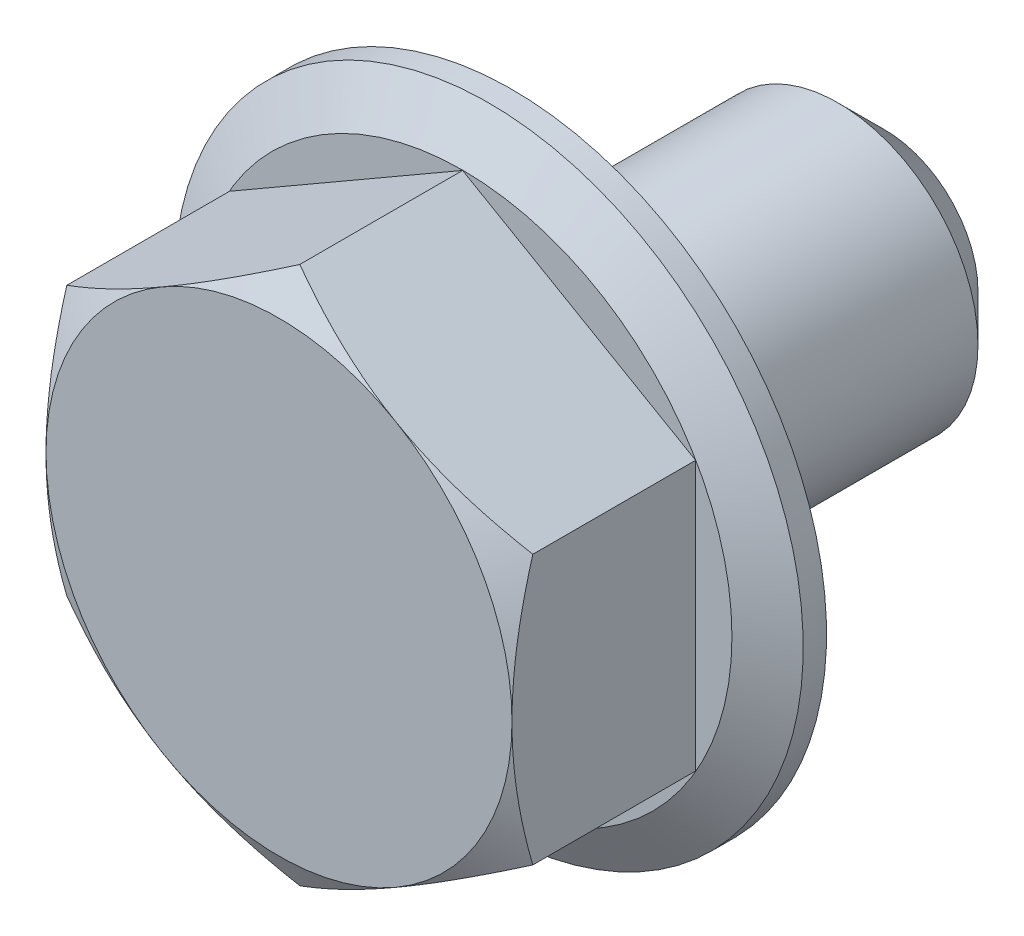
ISO-10303-21;
HEADER;
FILE_DESCRIPTION(('STEP AP214'),'2;1');
FILE_NAME('part.step','',(''),(''),'','','');
FILE_SCHEMA(('AUTOMOTIVE_DESIGN { 1 0 10303 214 1 1 1 1 }'));
ENDSEC;
DATA;
#1=APPLICATION_CONTEXT('core data for automotive mechanical design processes');
#2=APPLICATION_PROTOCOL_DEFINITION('international standard','automotive_design',2000,#1);
#3=PRODUCT_CONTEXT('',#1,'mechanical');
#4=PRODUCT('Part','Part','',(#3));
#5=PRODUCT_RELATED_PRODUCT_CATEGORY('part','',(#4));
#6=PRODUCT_DEFINITION_FORMATION('','',#4);
#7=PRODUCT_DEFINITION_CONTEXT('part definition',#1,'design');
#8=PRODUCT_DEFINITION('design','',#6,#7);
#9=PRODUCT_DEFINITION_SHAPE('','',#8);
#10=(LENGTH_UNIT() NAMED_UNIT(*) SI_UNIT(.MILLI.,.METRE.));
#11=(NAMED_UNIT(*) PLANE_ANGLE_UNIT() SI_UNIT($,.RADIAN.));
#12=(NAMED_UNIT(*) SI_UNIT($,.STERADIAN.) SOLID_ANGLE_UNIT());
#13=UNCERTAINTY_MEASURE_WITH_UNIT(LENGTH_MEASURE(1.E-05),#10,'distance_accuracy_value','');
#14=(GEOMETRIC_REPRESENTATION_CONTEXT(3) GLOBAL_UNCERTAINTY_ASSIGNED_CONTEXT((#13)) GLOBAL_UNIT_ASSIGNED_CONTEXT((#10,
#11,#12)) REPRESENTATION_CONTEXT('',''));
#15=CARTESIAN_POINT('',(0.,0.,0.));
#16=DIRECTION('',(0.,0.,1.));
#17=DIRECTION('',(1.,0.,0.));
#18=AXIS2_PLACEMENT_3D('',#15,#16,#17);
#19=CARTESIAN_POINT('',(0.,0.,0.5));
#20=DIRECTION('',(0.,0.,-1.));
#21=DIRECTION('',(-1.,0.,0.));
#22=AXIS2_PLACEMENT_3D('',#19,#20,#21);
#23=CONICAL_SURFACE('',#22,6.75,1.0471975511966);
#24=CARTESIAN_POINT('',(0.,0.,0.5));
#25=DIRECTION('',(0.,0.,-1.));
#26=DIRECTION('',(-1.,0.,0.));
#27=AXIS2_PLACEMENT_3D('',#24,#25,#26);
#28=CIRCLE('',#27,6.75);
#29=CARTESIAN_POINT('',(-6.75,0.,0.5));
#30=VERTEX_POINT('',#29);
#31=EDGE_CURVE('E188',#30,#30,#28,.T.);
#32=ORIENTED_EDGE('',*,*,#31,.F.);
#33=EDGE_LOOP('',(#32));
#34=FACE_BOUND('',#33,.T.);
#35=CARTESIAN_POINT('',(0.,0.,1.06));
#36=DIRECTION('',(0.,0.,1.));
#37=DIRECTION('',(1.,0.,0.));
#38=AXIS2_PLACEMENT_3D('',#35,#36,#37);
#39=CIRCLE('',#38,5.78005154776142);
#40=CARTESIAN_POINT('',(5.78005154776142,0.,1.06));
#41=VERTEX_POINT('',#40);
#42=EDGE_CURVE('E192',#41,#41,#39,.F.);
#43=ORIENTED_EDGE('',*,*,#42,.T.);
#44=EDGE_LOOP('',(#43));
#45=FACE_BOUND('',#44,.T.);
#46=ADVANCED_FACE('F14',(#34,#45),#23,.T.);
#47=CARTESIAN_POINT('',(0.,0.,-30.));
#48=DIRECTION('',(0.,0.,-1.));
#49=DIRECTION('',(-1.,0.,0.));
#50=AXIS2_PLACEMENT_3D('',#47,#48,#49);
#51=CYLINDRICAL_SURFACE('',#50,3.);
#52=CARTESIAN_POINT('',(0.,0.,-7.));
#53=DIRECTION('',(0.,0.,1.));
#54=DIRECTION('',(1.,0.,0.));
#55=AXIS2_PLACEMENT_3D('',#52,#53,#54);
#56=CIRCLE('',#55,3.);
#57=CARTESIAN_POINT('',(3.,0.,-7.));
#58=VERTEX_POINT('',#57);
#59=EDGE_CURVE('E177',#58,#58,#56,.T.);
#60=ORIENTED_EDGE('',*,*,#59,.T.);
#61=EDGE_LOOP('',(#60));
#62=FACE_BOUND('',#61,.T.);
#63=CARTESIAN_POINT('',(0.,0.,0.));
#64=DIRECTION('',(0.,0.,-1.));
#65=DIRECTION('',(-1.,0.,0.));
#66=AXIS2_PLACEMENT_3D('',#63,#64,#65);
#67=CIRCLE('',#66,3.);
#68=CARTESIAN_POINT('',(-3.,0.,0.));
#69=VERTEX_POINT('',#68);
#70=EDGE_CURVE('E180',#69,#69,#67,.T.);
#71=ORIENTED_EDGE('',*,*,#70,.T.);
#72=EDGE_LOOP('',(#71));
#73=FACE_BOUND('',#72,.T.);
#74=ADVANCED_FACE('F160',(#62,#73),#51,.T.);
#75=CARTESIAN_POINT('',(0.,3.,0.));
#76=DIRECTION('',(0.,0.,-1.));
#77=DIRECTION('',(-1.,0.,0.));
#78=AXIS2_PLACEMENT_3D('',#75,#76,#77);
#79=PLANE('',#78);
#80=CARTESIAN_POINT('',(0.,0.,0.));
#81=DIRECTION('',(0.,0.,-1.));
#82=DIRECTION('',(-1.,0.,0.));
#83=AXIS2_PLACEMENT_3D('',#80,#81,#82);
#84=CIRCLE('',#83,6.75);
#85=CARTESIAN_POINT('',(-6.75,0.,0.));
#86=VERTEX_POINT('',#85);
#87=EDGE_CURVE('E183',#86,#86,#84,.T.);
#88=ORIENTED_EDGE('',*,*,#87,.T.);
#89=EDGE_LOOP('',(#88));
#90=FACE_BOUND('',#89,.T.);
#91=ORIENTED_EDGE('',*,*,#70,.F.);
#92=EDGE_LOOP('',(#91));
#93=FACE_BOUND('',#92,.T.);
#94=ADVANCED_FACE('F164',(#90,#93),#79,.T.);
#95=CARTESIAN_POINT('',(0.,0.,-30.));
#96=DIRECTION('',(0.,0.,-1.));
#97=DIRECTION('',(-1.,0.,0.));
#98=AXIS2_PLACEMENT_3D('',#95,#96,#97);
#99=CYLINDRICAL_SURFACE('',#98,6.75);
#100=ORIENTED_EDGE('',*,*,#31,.T.);
#101=EDGE_LOOP('',(#100));
#102=FACE_BOUND('',#101,.T.);
#103=ORIENTED_EDGE('',*,*,#87,.F.);
#104=EDGE_LOOP('',(#103));
#105=FACE_BOUND('',#104,.T.);
#106=ADVANCED_FACE('F154',(#102,#105),#99,.T.);
#107=CARTESIAN_POINT('',(0.,3.,-8.));
#108=DIRECTION('',(0.,0.,1.));
#109=DIRECTION('',(1.,0.,0.));
#110=AXIS2_PLACEMENT_3D('',#107,#108,#109);
#111=PLANE('',#110);
#112=CARTESIAN_POINT('',(0.,0.,-8.));
#113=DIRECTION('',(0.,0.,1.));
#114=DIRECTION('',(1.,0.,0.));
#115=AXIS2_PLACEMENT_3D('',#112,#113,#114);
#116=CIRCLE('',#115,2.);
#117=CARTESIAN_POINT('',(2.,0.,-8.));
#118=VERTEX_POINT('',#117);
#119=EDGE_CURVE('E182',#118,#118,#116,.F.);
#120=ORIENTED_EDGE('',*,*,#119,.T.);
#121=EDGE_LOOP('',(#120));
#122=FACE_BOUND('',#121,.T.);
#123=ADVANCED_FACE('F150',(#122),#111,.F.);
#124=CARTESIAN_POINT('',(0.,0.,1.06));
#125=DIRECTION('',(0.,0.,1.));
#126=DIRECTION('',(1.,0.,0.));
#127=AXIS2_PLACEMENT_3D('',#124,#125,#126);
#128=PLANE('',#127);
#129=ORIENTED_EDGE('',*,*,#42,.F.);
#130=EDGE_LOOP('',(#129));
#131=FACE_BOUND('',#130,.T.);
#132=DIRECTION('',(0.,-1.,0.));
#133=VECTOR('',#132,1.);
#134=CARTESIAN_POINT('',(5.,2.88675134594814,1.06));
#135=LINE('',#134,#133);
#136=CARTESIAN_POINT('',(5.,2.88675134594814,1.06));
#137=VERTEX_POINT('',#136);
#138=CARTESIAN_POINT('',(5.,-2.88675134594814,1.06));
#139=VERTEX_POINT('',#138);
#140=EDGE_CURVE('E230',#137,#139,#135,.T.);
#141=ORIENTED_EDGE('',*,*,#140,.T.);
#142=DIRECTION('',(-0.866025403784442,-0.5,0.));
#143=VECTOR('',#142,1.);
#144=CARTESIAN_POINT('',(5.,-2.88675134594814,1.06));
#145=LINE('',#144,#143);
#146=CARTESIAN_POINT('',(0.,-5.77350269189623,1.06));
#147=VERTEX_POINT('',#146);
#148=EDGE_CURVE('E231',#139,#147,#145,.T.);
#149=ORIENTED_EDGE('',*,*,#148,.T.);
#150=DIRECTION('',(0.866025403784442,-0.5,0.));
#151=VECTOR('',#150,1.);
#152=CARTESIAN_POINT('',(-5.,-2.88675134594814,1.06));
#153=LINE('',#152,#151);
#154=CARTESIAN_POINT('',(-5.,-2.88675134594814,1.06));
#155=VERTEX_POINT('',#154);
#156=EDGE_CURVE('E210',#155,#147,#153,.T.);
#157=ORIENTED_EDGE('',*,*,#156,.F.);
#158=DIRECTION('',(0.,-1.,0.));
#159=VECTOR('',#158,1.);
#160=CARTESIAN_POINT('',(-5.,2.88675134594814,1.06));
#161=LINE('',#160,#159);
#162=CARTESIAN_POINT('',(-5.,2.88675134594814,1.06));
#163=VERTEX_POINT('',#162);
#164=EDGE_CURVE('E237',#163,#155,#161,.T.);
#165=ORIENTED_EDGE('',*,*,#164,.F.);
#166=DIRECTION('',(0.866025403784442,0.5,0.));
#167=VECTOR('',#166,1.);
#168=CARTESIAN_POINT('',(-5.,2.88675134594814,1.06));
#169=LINE('',#168,#167);
#170=CARTESIAN_POINT('',(0.,5.77350269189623,1.06));
#171=VERTEX_POINT('',#170);
#172=EDGE_CURVE('E250',#163,#171,#169,.T.);
#173=ORIENTED_EDGE('',*,*,#172,.T.);
#174=DIRECTION('',(-0.866025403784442,0.5,0.));
#175=VECTOR('',#174,1.);
#176=CARTESIAN_POINT('',(5.,2.88675134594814,1.06));
#177=LINE('',#176,#175);
#178=EDGE_CURVE('E95',#137,#171,#177,.T.);
#179=ORIENTED_EDGE('',*,*,#178,.F.);
#180=EDGE_LOOP('',(#141,#149,#157,#165,#173,#179));
#181=FACE_BOUND('',#180,.T.);
#182=ADVANCED_FACE('F147',(#131,#181),#128,.T.);
#183=CARTESIAN_POINT('',(5.,2.88675134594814,1.06));
#184=DIRECTION('',(0.5,0.866025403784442,0.));
#185=DIRECTION('',(-0.866025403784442,0.5,0.));
#186=AXIS2_PLACEMENT_3D('',#183,#184,#185);
#187=PLANE('',#186);
#188=CARTESIAN_POINT('',(5.0002,2.8866358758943,4.55335134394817));
#189=CARTESIAN_POINT('',(4.78046540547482,3.01349970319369,4.62661343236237));
#190=CARTESIAN_POINT('',(4.55885141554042,3.1414485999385,4.69324867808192));
#191=CARTESIAN_POINT('',(4.11178600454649,3.39956193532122,4.8095610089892));
#192=CARTESIAN_POINT('',(3.88632664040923,3.52973095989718,4.85919695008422));
#193=CARTESIAN_POINT('',(3.43816769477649,3.78847564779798,4.93644897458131));
#194=CARTESIAN_POINT('',(3.21553790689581,3.91701101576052,4.96457962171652));
#195=CARTESIAN_POINT('',(2.88081009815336,4.11026620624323,4.98980507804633));
#196=CARTESIAN_POINT('',(2.76915780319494,4.17472868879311,4.99538654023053));
#197=CARTESIAN_POINT('',(2.5457500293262,4.30371322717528,5.00079778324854));
#198=CARTESIAN_POINT('',(2.43399455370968,4.36823528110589,5.00062774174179));
#199=CARTESIAN_POINT('',(2.12781576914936,4.54500768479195,4.99224636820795));
#200=CARTESIAN_POINT('',(1.93349391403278,4.65719946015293,4.97817022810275));
#201=CARTESIAN_POINT('',(1.54613989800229,4.88083840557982,4.93353474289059));
#202=CARTESIAN_POINT('',(1.35310909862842,4.99228478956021,4.9029601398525));
#203=CARTESIAN_POINT('',(0.964974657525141,5.21637431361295,4.82653150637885));
#204=CARTESIAN_POINT('',(0.769920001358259,5.32898917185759,4.78035362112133));
#205=CARTESIAN_POINT('',(0.382719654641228,5.55253939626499,4.67554820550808));
#206=CARTESIAN_POINT('',(0.190569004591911,5.66347762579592,4.61694529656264));
#207=CARTESIAN_POINT('',(-0.000199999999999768,5.7736181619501,4.55335134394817));
#208=B_SPLINE_CURVE_WITH_KNOTS('',3,(#188,#189,#190,#191,#192,#193,#194,#195,#196,#197,#198,
#199,#200,#201,#202,#203,#204,#205,#206,#207),.UNSPECIFIED.,.F.,.F.,(4,2,2,2,2,2,2,2,2,4),(0.,
0.792555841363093,1.58701660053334,2.36181537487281,2.74884076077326,3.13585419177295,
3.8096236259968,4.4840172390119,5.17336882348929,5.86136694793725),.UNSPECIFIED.);
#209=CARTESIAN_POINT('',(5.,2.88675134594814,4.5534180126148));
#210=VERTEX_POINT('',#209);
#211=CARTESIAN_POINT('',(2.5,4.3301270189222,5.));
#212=VERTEX_POINT('',#211);
#213=EDGE_CURVE('E104',#210,#212,#208,.T.);
#214=ORIENTED_EDGE('',*,*,#213,.F.);
#215=DIRECTION('',(0.,0.,1.));
#216=VECTOR('',#215,1.);
#217=CARTESIAN_POINT('',(5.,2.88675134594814,1.06));
#218=LINE('',#217,#216);
#219=EDGE_CURVE('E115',#137,#210,#218,.T.);
#220=ORIENTED_EDGE('',*,*,#219,.F.);
#221=ORIENTED_EDGE('',*,*,#178,.T.);
#222=DIRECTION('',(0.,0.,1.));
#223=VECTOR('',#222,1.);
#224=CARTESIAN_POINT('',(0.,5.77350269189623,1.06));
#225=LINE('',#224,#223);
#226=CARTESIAN_POINT('',(0.,5.77350269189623,4.55341801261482));
#227=VERTEX_POINT('',#226);
#228=EDGE_CURVE('E234',#171,#227,#225,.T.);
#229=ORIENTED_EDGE('',*,*,#228,.T.);
#230=EDGE_CURVE('E256',#212,#227,#208,.T.);
#231=ORIENTED_EDGE('',*,*,#230,.F.);
#232=EDGE_LOOP('',(#214,#220,#221,#229,#231));
#233=FACE_BOUND('',#232,.T.);
#234=ADVANCED_FACE('F145',(#233),#187,.T.);
#235=CARTESIAN_POINT('',(5.,2.88675134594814,1.06));
#236=DIRECTION('',(-1.,0.,0.));
#237=DIRECTION('',(0.,0.,1.));
#238=AXIS2_PLACEMENT_3D('',#235,#236,#237);
#239=PLANE('',#238);
#240=ORIENTED_EDGE('',*,*,#219,.T.);
#241=CARTESIAN_POINT('',(5.,-7.78230038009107,2.5462083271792));
#242=CARTESIAN_POINT('',(5.,-7.56368507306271,2.65236916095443));
#243=CARTESIAN_POINT('',(5.,-7.34457094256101,2.75752021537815));
#244=CARTESIAN_POINT('',(5.,-6.9050798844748,2.96523542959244));
#245=CARTESIAN_POINT('',(5.,-6.68470276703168,3.06779918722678));
#246=CARTESIAN_POINT('',(5.,-6.24129853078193,3.27028248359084));
#247=CARTESIAN_POINT('',(5.,-6.01826353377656,3.37018482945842));
#248=CARTESIAN_POINT('',(5.,-5.5704294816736,3.5659388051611));
#249=CARTESIAN_POINT('',(5.,-5.34563050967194,3.66179062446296));
#250=CARTESIAN_POINT('',(5.,-4.88653642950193,3.85142125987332));
#251=CARTESIAN_POINT('',(5.,-4.652170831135,3.94503034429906));
#252=CARTESIAN_POINT('',(5.,-4.18070803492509,4.12523170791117));
#253=CARTESIAN_POINT('',(5.,-3.94361053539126,4.21182320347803));
#254=CARTESIAN_POINT('',(5.,-3.46674159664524,4.37573676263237));
#255=CARTESIAN_POINT('',(5.,-3.22697658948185,4.45307735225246));
#256=CARTESIAN_POINT('',(5.,-2.74400707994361,4.59602583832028));
#257=CARTESIAN_POINT('',(5.,-2.50080367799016,4.66163740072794));
#258=CARTESIAN_POINT('',(5.,-2.01218127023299,4.77764524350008));
#259=CARTESIAN_POINT('',(5.,-1.76678255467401,4.82812542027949));
#260=CARTESIAN_POINT('',(5.,-1.27290368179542,4.91103962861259));
#261=CARTESIAN_POINT('',(5.,-1.02442382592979,4.94347541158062));
#262=CARTESIAN_POINT('',(5.,-0.528880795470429,4.98728983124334));
#263=CARTESIAN_POINT('',(5.,-0.281842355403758,4.99894131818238));
#264=CARTESIAN_POINT('',(5.,0.212340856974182,5.00091924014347));
#265=CARTESIAN_POINT('',(5.,0.45948563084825,4.99124535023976));
#266=CARTESIAN_POINT('',(5.,0.878236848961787,4.95747451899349));
#267=CARTESIAN_POINT('',(5.,1.05028791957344,4.93856786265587));
#268=CARTESIAN_POINT('',(5.,1.39314143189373,4.89158148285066));
#269=CARTESIAN_POINT('',(5.,1.56394370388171,4.86350053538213));
#270=CARTESIAN_POINT('',(5.,2.0742445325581,4.76697097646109));
#271=CARTESIAN_POINT('',(5.,2.41144863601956,4.68625287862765));
#272=CARTESIAN_POINT('',(5.,2.91568382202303,4.54615066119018));
#273=CARTESIAN_POINT('',(5.,3.08532535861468,4.49562535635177));
#274=CARTESIAN_POINT('',(5.,3.42296084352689,4.3892928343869));
#275=CARTESIAN_POINT('',(5.,3.5909547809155,4.33348558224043));
#276=CARTESIAN_POINT('',(5.,3.92534748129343,4.21748755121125));
#277=CARTESIAN_POINT('',(5.,4.09174674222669,4.15729819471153));
#278=CARTESIAN_POINT('',(5.,4.42316447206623,4.03324744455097));
#279=CARTESIAN_POINT('',(5.,4.5881829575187,3.96938609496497));
#280=CARTESIAN_POINT('',(5.,4.97894336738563,3.81395873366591));
#281=CARTESIAN_POINT('',(5.,5.2041383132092,3.72102005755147));
#282=CARTESIAN_POINT('',(5.,5.65259490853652,3.53057642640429));
#283=CARTESIAN_POINT('',(5.,5.87585643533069,3.43307118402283));
#284=CARTESIAN_POINT('',(5.,6.32080399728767,3.23441654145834));
#285=CARTESIAN_POINT('',(5.,6.54248969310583,3.13326638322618));
#286=CARTESIAN_POINT('',(5.,6.98450924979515,2.9280497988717));
#287=CARTESIAN_POINT('',(5.,7.20484308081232,2.82398330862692));
#288=CARTESIAN_POINT('',(5.,7.86463789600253,2.50803519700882));
#289=CARTESIAN_POINT('',(5.,8.30240776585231,2.29262431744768));
#290=CARTESIAN_POINT('',(5.,9.17469391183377,1.85548830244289));
#291=CARTESIAN_POINT('',(5.,9.60921058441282,1.63376395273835));
#292=CARTESIAN_POINT('',(5.,10.4392411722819,1.20477142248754));
#293=CARTESIAN_POINT('',(5.,10.8349438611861,0.997867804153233));
#294=CARTESIAN_POINT('',(5.,11.6248724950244,0.581230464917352));
#295=CARTESIAN_POINT('',(5.,12.0190983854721,0.371496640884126));
#296=CARTESIAN_POINT('',(5.,12.8053933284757,-0.0495892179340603));
#297=CARTESIAN_POINT('',(5.,13.1974653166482,-0.260935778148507));
#298=CARTESIAN_POINT('',(5.,13.9806656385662,-0.685318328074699));
#299=CARTESIAN_POINT('',(5.,14.3717940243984,-0.89835422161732));
#300=CARTESIAN_POINT('',(5.,14.76257565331,-1.112019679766));
#301=B_SPLINE_CURVE_WITH_KNOTS('',3,(#241,#242,#243,#244,#245,#246,#247,#248,#249,#250,#251,
#252,#253,#254,#255,#256,#257,#258,#259,#260,#261,#262,#263,#264,#265,#266,#267,#268,#269,#270,
#271,#272,#273,#274,#275,#276,#277,#278,#279,#280,#281,#282,#283,#284,#285,#286,#287,#288,#289,
#290,#291,#292,#293,#294,#295,#296,#297,#298,#299,#300),.UNSPECIFIED.,.F.,.F.,(4,2,2,2,2,2,2,2,
2,2,2,2,2,2,2,2,2,2,2,2,2,2,2,2,2,2,2,2,2,4),(0.,0.729093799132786,1.4583002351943,
2.1914294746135,2.92452438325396,3.68154321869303,4.43864647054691,5.19420720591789,
5.94953137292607,6.70058667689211,7.45156906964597,8.19261813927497,8.9336785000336,
9.45268753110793,9.97176583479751,11.0104876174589,11.5414595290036,12.0724349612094,
12.6032388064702,13.1340362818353,13.864826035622,14.5956618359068,15.3266505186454,
16.0576552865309,17.5212598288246,18.9846830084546,20.3242601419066,21.6638862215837,
23.0001040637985,24.3362463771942),.UNSPECIFIED.);
#302=CARTESIAN_POINT('',(5.,0.,5.));
#303=VERTEX_POINT('',#302);
#304=EDGE_CURVE('E97',#210,#303,#301,.F.);
#305=ORIENTED_EDGE('',*,*,#304,.T.);
#306=CARTESIAN_POINT('',(5.,-2.88675134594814,4.5534180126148));
#307=VERTEX_POINT('',#306);
#308=EDGE_CURVE('E85',#303,#307,#301,.F.);
#309=ORIENTED_EDGE('',*,*,#308,.T.);
#310=DIRECTION('',(0.,0.,1.));
#311=VECTOR('',#310,1.);
#312=CARTESIAN_POINT('',(5.,-2.88675134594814,1.06));
#313=LINE('',#312,#311);
#314=EDGE_CURVE('E214',#139,#307,#313,.T.);
#315=ORIENTED_EDGE('',*,*,#314,.F.);
#316=ORIENTED_EDGE('',*,*,#140,.F.);
#317=EDGE_LOOP('',(#240,#305,#309,#315,#316));
#318=FACE_BOUND('',#317,.T.);
#319=ADVANCED_FACE('F113',(#318),#239,.F.);
#320=CARTESIAN_POINT('',(5.,-2.88675134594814,1.06));
#321=DIRECTION('',(-0.5,0.866025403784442,0.));
#322=DIRECTION('',(-0.866025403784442,-0.5,0.));
#323=AXIS2_PLACEMENT_3D('',#320,#321,#322);
#324=PLANE('',#323);
#325=ORIENTED_EDGE('',*,*,#314,.T.);
#326=CARTESIAN_POINT('',(5.0002,-2.8866358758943,4.55335134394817));
#327=CARTESIAN_POINT('',(4.78046540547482,-3.01349970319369,4.62661343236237));
#328=CARTESIAN_POINT('',(4.55885141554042,-3.1414485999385,4.69324867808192));
#329=CARTESIAN_POINT('',(4.11178600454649,-3.39956193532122,4.8095610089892));
#330=CARTESIAN_POINT('',(3.88632664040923,-3.52973095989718,4.85919695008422));
#331=CARTESIAN_POINT('',(3.43816769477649,-3.78847564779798,4.93644897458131));
#332=CARTESIAN_POINT('',(3.21553790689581,-3.91701101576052,4.96457962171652));
#333=CARTESIAN_POINT('',(2.88081009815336,-4.11026620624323,4.98980507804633));
#334=CARTESIAN_POINT('',(2.76915780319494,-4.17472868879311,4.99538654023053));
#335=CARTESIAN_POINT('',(2.5457500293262,-4.30371322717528,5.00079778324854));
#336=CARTESIAN_POINT('',(2.43399455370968,-4.36823528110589,5.00062774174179));
#337=CARTESIAN_POINT('',(2.12781576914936,-4.54500768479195,4.99224636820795));
#338=CARTESIAN_POINT('',(1.93349391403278,-4.65719946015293,4.97817022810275));
#339=CARTESIAN_POINT('',(1.54613989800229,-4.88083840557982,4.93353474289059));
#340=CARTESIAN_POINT('',(1.35310909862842,-4.99228478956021,4.9029601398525));
#341=CARTESIAN_POINT('',(0.964974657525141,-5.21637431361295,4.82653150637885));
#342=CARTESIAN_POINT('',(0.769920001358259,-5.32898917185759,4.78035362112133));
#343=CARTESIAN_POINT('',(0.382719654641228,-5.55253939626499,4.67554820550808));
#344=CARTESIAN_POINT('',(0.190569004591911,-5.66347762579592,4.61694529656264));
#345=CARTESIAN_POINT('',(-0.000199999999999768,-5.7736181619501,4.55335134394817));
#346=B_SPLINE_CURVE_WITH_KNOTS('',3,(#326,#327,#328,#329,#330,#331,#332,#333,#334,#335,#336,
#337,#338,#339,#340,#341,#342,#343,#344,#345),.UNSPECIFIED.,.F.,.F.,(4,2,2,2,2,2,2,2,2,4),(0.,
0.792555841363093,1.58701660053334,2.36181537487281,2.74884076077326,3.13585419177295,
3.8096236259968,4.4840172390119,5.17336882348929,5.86136694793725),.UNSPECIFIED.);
#347=CARTESIAN_POINT('',(2.5,-4.3301270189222,5.));
#348=VERTEX_POINT('',#347);
#349=EDGE_CURVE('E91',#307,#348,#346,.T.);
#350=ORIENTED_EDGE('',*,*,#349,.T.);
#351=CARTESIAN_POINT('',(0.,-5.77350269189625,4.55341801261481));
#352=VERTEX_POINT('',#351);
#353=EDGE_CURVE('E30',#348,#352,#346,.T.);
#354=ORIENTED_EDGE('',*,*,#353,.T.);
#355=DIRECTION('',(0.,0.,1.));
#356=VECTOR('',#355,1.);
#357=CARTESIAN_POINT('',(0.,-5.77350269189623,1.06));
#358=LINE('',#357,#356);
#359=EDGE_CURVE('E208',#147,#352,#358,.T.);
#360=ORIENTED_EDGE('',*,*,#359,.F.);
#361=ORIENTED_EDGE('',*,*,#148,.F.);
#362=EDGE_LOOP('',(#325,#350,#354,#360,#361));
#363=FACE_BOUND('',#362,.T.);
#364=ADVANCED_FACE('F144',(#363),#324,.F.);
#365=CARTESIAN_POINT('',(-5.,-2.88675134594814,1.06));
#366=DIRECTION('',(-0.5,-0.866025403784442,0.));
#367=DIRECTION('',(0.866025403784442,-0.5,0.));
#368=AXIS2_PLACEMENT_3D('',#365,#366,#367);
#369=PLANE('',#368);
#370=CARTESIAN_POINT('',(-5.0002,-2.8866358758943,4.55335134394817));
#371=CARTESIAN_POINT('',(-4.78046540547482,-3.01349970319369,4.62661343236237));
#372=CARTESIAN_POINT('',(-4.55885141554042,-3.1414485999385,4.69324867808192));
#373=CARTESIAN_POINT('',(-4.11178600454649,-3.39956193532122,4.8095610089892));
#374=CARTESIAN_POINT('',(-3.88632664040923,-3.52973095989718,4.85919695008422));
#375=CARTESIAN_POINT('',(-3.43816769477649,-3.78847564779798,4.93644897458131));
#376=CARTESIAN_POINT('',(-3.21553790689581,-3.91701101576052,4.96457962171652));
#377=CARTESIAN_POINT('',(-2.88081009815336,-4.11026620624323,4.98980507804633));
#378=CARTESIAN_POINT('',(-2.76915780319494,-4.17472868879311,4.99538654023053));
#379=CARTESIAN_POINT('',(-2.5457500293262,-4.30371322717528,5.00079778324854));
#380=CARTESIAN_POINT('',(-2.43399455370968,-4.36823528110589,5.00062774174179));
#381=CARTESIAN_POINT('',(-2.12781576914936,-4.54500768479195,4.99224636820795));
#382=CARTESIAN_POINT('',(-1.93349391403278,-4.65719946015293,4.97817022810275));
#383=CARTESIAN_POINT('',(-1.54613989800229,-4.88083840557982,4.93353474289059));
#384=CARTESIAN_POINT('',(-1.35310909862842,-4.99228478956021,4.9029601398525));
#385=CARTESIAN_POINT('',(-0.964974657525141,-5.21637431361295,4.82653150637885));
#386=CARTESIAN_POINT('',(-0.769920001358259,-5.32898917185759,4.78035362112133));
#387=CARTESIAN_POINT('',(-0.382719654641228,-5.55253939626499,4.67554820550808));
#388=CARTESIAN_POINT('',(-0.190569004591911,-5.66347762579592,4.61694529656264));
#389=CARTESIAN_POINT('',(0.000199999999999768,-5.7736181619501,4.55335134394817));
#390=B_SPLINE_CURVE_WITH_KNOTS('',3,(#370,#371,#372,#373,#374,#375,#376,#377,#378,#379,#380,
#381,#382,#383,#384,#385,#386,#387,#388,#389),.UNSPECIFIED.,.F.,.F.,(4,2,2,2,2,2,2,2,2,4),(0.,
0.792555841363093,1.58701660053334,2.36181537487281,2.74884076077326,3.13585419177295,
3.8096236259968,4.4840172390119,5.17336882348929,5.86136694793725),.UNSPECIFIED.);
#391=CARTESIAN_POINT('',(-5.,-2.88675134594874,4.5534180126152));
#392=VERTEX_POINT('',#391);
#393=CARTESIAN_POINT('',(-2.5,-4.3301270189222,5.));
#394=VERTEX_POINT('',#393);
#395=EDGE_CURVE('E37',#392,#394,#390,.T.);
#396=ORIENTED_EDGE('',*,*,#395,.F.);
#397=DIRECTION('',(0.,0.,1.));
#398=VECTOR('',#397,1.);
#399=CARTESIAN_POINT('',(-5.,-2.88675134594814,1.06));
#400=LINE('',#399,#398);
#401=EDGE_CURVE('E215',#155,#392,#400,.T.);
#402=ORIENTED_EDGE('',*,*,#401,.F.);
#403=ORIENTED_EDGE('',*,*,#156,.T.);
#404=ORIENTED_EDGE('',*,*,#359,.T.);
#405=EDGE_CURVE('E116',#394,#352,#390,.T.);
#406=ORIENTED_EDGE('',*,*,#405,.F.);
#407=EDGE_LOOP('',(#396,#402,#403,#404,#406));
#408=FACE_BOUND('',#407,.T.);
#409=ADVANCED_FACE('F205',(#408),#369,.T.);
#410=CARTESIAN_POINT('',(-5.,2.88675134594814,1.06));
#411=DIRECTION('',(-1.,0.,0.));
#412=DIRECTION('',(0.,0.,1.));
#413=AXIS2_PLACEMENT_3D('',#410,#411,#412);
#414=PLANE('',#413);
#415=CARTESIAN_POINT('',(-5.,-7.78230038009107,2.5462083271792));
#416=CARTESIAN_POINT('',(-5.,-7.56368507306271,2.65236916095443));
#417=CARTESIAN_POINT('',(-5.,-7.34457094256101,2.75752021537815));
#418=CARTESIAN_POINT('',(-5.,-6.9050798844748,2.96523542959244));
#419=CARTESIAN_POINT('',(-5.,-6.68470276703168,3.06779918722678));
#420=CARTESIAN_POINT('',(-5.,-6.24129853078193,3.27028248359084));
#421=CARTESIAN_POINT('',(-5.,-6.01826353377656,3.37018482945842));
#422=CARTESIAN_POINT('',(-5.,-5.5704294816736,3.5659388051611));
#423=CARTESIAN_POINT('',(-5.,-5.34563050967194,3.66179062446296));
#424=CARTESIAN_POINT('',(-5.,-4.88653642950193,3.85142125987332));
#425=CARTESIAN_POINT('',(-5.,-4.652170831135,3.94503034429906));
#426=CARTESIAN_POINT('',(-5.,-4.18070803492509,4.12523170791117));
#427=CARTESIAN_POINT('',(-5.,-3.94361053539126,4.21182320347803));
#428=CARTESIAN_POINT('',(-5.,-3.46674159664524,4.37573676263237));
#429=CARTESIAN_POINT('',(-5.,-3.22697658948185,4.45307735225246));
#430=CARTESIAN_POINT('',(-5.,-2.74400707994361,4.59602583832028));
#431=CARTESIAN_POINT('',(-5.,-2.50080367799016,4.66163740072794));
#432=CARTESIAN_POINT('',(-5.,-2.01218127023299,4.77764524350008));
#433=CARTESIAN_POINT('',(-5.,-1.76678255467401,4.82812542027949));
#434=CARTESIAN_POINT('',(-5.,-1.27290368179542,4.91103962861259));
#435=CARTESIAN_POINT('',(-5.,-1.02442382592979,4.94347541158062));
#436=CARTESIAN_POINT('',(-5.,-0.528880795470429,4.98728983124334));
#437=CARTESIAN_POINT('',(-5.,-0.281842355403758,4.99894131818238));
#438=CARTESIAN_POINT('',(-5.,0.212340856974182,5.00091924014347));
#439=CARTESIAN_POINT('',(-5.,0.45948563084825,4.99124535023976));
#440=CARTESIAN_POINT('',(-5.,0.878236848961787,4.95747451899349));
#441=CARTESIAN_POINT('',(-5.,1.05028791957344,4.93856786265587));
#442=CARTESIAN_POINT('',(-5.,1.39314143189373,4.89158148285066));
#443=CARTESIAN_POINT('',(-5.,1.56394370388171,4.86350053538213));
#444=CARTESIAN_POINT('',(-5.,2.0742445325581,4.76697097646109));
#445=CARTESIAN_POINT('',(-5.,2.41144863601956,4.68625287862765));
#446=CARTESIAN_POINT('',(-5.,2.91568382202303,4.54615066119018));
#447=CARTESIAN_POINT('',(-5.,3.08532535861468,4.49562535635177));
#448=CARTESIAN_POINT('',(-5.,3.42296084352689,4.3892928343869));
#449=CARTESIAN_POINT('',(-5.,3.5909547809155,4.33348558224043));
#450=CARTESIAN_POINT('',(-5.,3.92534748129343,4.21748755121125));
#451=CARTESIAN_POINT('',(-5.,4.09174674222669,4.15729819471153));
#452=CARTESIAN_POINT('',(-5.,4.42316447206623,4.03324744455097));
#453=CARTESIAN_POINT('',(-5.,4.5881829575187,3.96938609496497));
#454=CARTESIAN_POINT('',(-5.,4.97894336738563,3.81395873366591));
#455=CARTESIAN_POINT('',(-5.,5.2041383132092,3.72102005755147));
#456=CARTESIAN_POINT('',(-5.,5.65259490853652,3.53057642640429));
#457=CARTESIAN_POINT('',(-5.,5.87585643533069,3.43307118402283));
#458=CARTESIAN_POINT('',(-5.,6.32080399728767,3.23441654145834));
#459=CARTESIAN_POINT('',(-5.,6.54248969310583,3.13326638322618));
#460=CARTESIAN_POINT('',(-5.,6.98450924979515,2.9280497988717));
#461=CARTESIAN_POINT('',(-5.,7.20484308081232,2.82398330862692));
#462=CARTESIAN_POINT('',(-5.,7.86463789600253,2.50803519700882));
#463=CARTESIAN_POINT('',(-5.,8.30240776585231,2.29262431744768));
#464=CARTESIAN_POINT('',(-5.,9.17469391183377,1.85548830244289));
#465=CARTESIAN_POINT('',(-5.,9.60921058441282,1.63376395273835));
#466=CARTESIAN_POINT('',(-5.,10.4392411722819,1.20477142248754));
#467=CARTESIAN_POINT('',(-5.,10.8349438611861,0.997867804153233));
#468=CARTESIAN_POINT('',(-5.,11.6248724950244,0.581230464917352));
#469=CARTESIAN_POINT('',(-5.,12.0190983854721,0.371496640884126));
#470=CARTESIAN_POINT('',(-5.,12.8053933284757,-0.0495892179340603));
#471=CARTESIAN_POINT('',(-5.,13.1974653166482,-0.260935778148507));
#472=CARTESIAN_POINT('',(-5.,13.9806656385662,-0.685318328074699));
#473=CARTESIAN_POINT('',(-5.,14.3717940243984,-0.89835422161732));
#474=CARTESIAN_POINT('',(-5.,14.76257565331,-1.112019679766));
#475=B_SPLINE_CURVE_WITH_KNOTS('',3,(#415,#416,#417,#418,#419,#420,#421,#422,#423,#424,#425,
#426,#427,#428,#429,#430,#431,#432,#433,#434,#435,#436,#437,#438,#439,#440,#441,#442,#443,#444,
#445,#446,#447,#448,#449,#450,#451,#452,#453,#454,#455,#456,#457,#458,#459,#460,#461,#462,#463,
#464,#465,#466,#467,#468,#469,#470,#471,#472,#473,#474),.UNSPECIFIED.,.F.,.F.,(4,2,2,2,2,2,2,2,
2,2,2,2,2,2,2,2,2,2,2,2,2,2,2,2,2,2,2,2,2,4),(0.,0.729093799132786,1.4583002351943,
2.1914294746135,2.92452438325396,3.68154321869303,4.43864647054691,5.19420720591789,
5.94953137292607,6.70058667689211,7.45156906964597,8.19261813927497,8.9336785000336,
9.45268753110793,9.97176583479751,11.0104876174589,11.5414595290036,12.0724349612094,
12.6032388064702,13.1340362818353,13.864826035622,14.5956618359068,15.3266505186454,
16.0576552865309,17.5212598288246,18.9846830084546,20.3242601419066,21.6638862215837,
23.0001040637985,24.3362463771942),.UNSPECIFIED.);
#476=CARTESIAN_POINT('',(-5.,2.88675134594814,4.5534180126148));
#477=VERTEX_POINT('',#476);
#478=CARTESIAN_POINT('',(-5.,0.,5.));
#479=VERTEX_POINT('',#478);
#480=EDGE_CURVE('E255',#477,#479,#475,.F.);
#481=ORIENTED_EDGE('',*,*,#480,.F.);
#482=DIRECTION('',(0.,0.,1.));
#483=VECTOR('',#482,1.);
#484=CARTESIAN_POINT('',(-5.,2.88675134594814,1.06));
#485=LINE('',#484,#483);
#486=EDGE_CURVE('E218',#163,#477,#485,.T.);
#487=ORIENTED_EDGE('',*,*,#486,.F.);
#488=ORIENTED_EDGE('',*,*,#164,.T.);
#489=ORIENTED_EDGE('',*,*,#401,.T.);
#490=EDGE_CURVE('E118',#479,#392,#475,.F.);
#491=ORIENTED_EDGE('',*,*,#490,.F.);
#492=EDGE_LOOP('',(#481,#487,#488,#489,#491));
#493=FACE_BOUND('',#492,.T.);
#494=ADVANCED_FACE('F254',(#493),#414,.T.);
#495=CARTESIAN_POINT('',(-5.,2.88675134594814,1.06));
#496=DIRECTION('',(0.5,-0.866025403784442,0.));
#497=DIRECTION('',(0.866025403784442,0.5,0.));
#498=AXIS2_PLACEMENT_3D('',#495,#496,#497);
#499=PLANE('',#498);
#500=ORIENTED_EDGE('',*,*,#486,.T.);
#501=CARTESIAN_POINT('',(-5.0002,2.8866358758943,4.55335134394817));
#502=CARTESIAN_POINT('',(-4.78046540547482,3.01349970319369,4.62661343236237));
#503=CARTESIAN_POINT('',(-4.55885141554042,3.1414485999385,4.69324867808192));
#504=CARTESIAN_POINT('',(-4.11178600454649,3.39956193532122,4.8095610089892));
#505=CARTESIAN_POINT('',(-3.88632664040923,3.52973095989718,4.85919695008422));
#506=CARTESIAN_POINT('',(-3.43816769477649,3.78847564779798,4.93644897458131));
#507=CARTESIAN_POINT('',(-3.21553790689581,3.91701101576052,4.96457962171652));
#508=CARTESIAN_POINT('',(-2.88081009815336,4.11026620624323,4.98980507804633));
#509=CARTESIAN_POINT('',(-2.76915780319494,4.17472868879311,4.99538654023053));
#510=CARTESIAN_POINT('',(-2.5457500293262,4.30371322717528,5.00079778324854));
#511=CARTESIAN_POINT('',(-2.43399455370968,4.36823528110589,5.00062774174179));
#512=CARTESIAN_POINT('',(-2.12781576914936,4.54500768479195,4.99224636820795));
#513=CARTESIAN_POINT('',(-1.93349391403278,4.65719946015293,4.97817022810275));
#514=CARTESIAN_POINT('',(-1.54613989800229,4.88083840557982,4.93353474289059));
#515=CARTESIAN_POINT('',(-1.35310909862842,4.99228478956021,4.9029601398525));
#516=CARTESIAN_POINT('',(-0.964974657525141,5.21637431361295,4.82653150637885));
#517=CARTESIAN_POINT('',(-0.769920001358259,5.32898917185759,4.78035362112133));
#518=CARTESIAN_POINT('',(-0.382719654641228,5.55253939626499,4.67554820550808));
#519=CARTESIAN_POINT('',(-0.190569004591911,5.66347762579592,4.61694529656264));
#520=CARTESIAN_POINT('',(0.000199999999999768,5.7736181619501,4.55335134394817));
#521=B_SPLINE_CURVE_WITH_KNOTS('',3,(#501,#502,#503,#504,#505,#506,#507,#508,#509,#510,#511,
#512,#513,#514,#515,#516,#517,#518,#519,#520),.UNSPECIFIED.,.F.,.F.,(4,2,2,2,2,2,2,2,2,4),(0.,
0.792555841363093,1.58701660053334,2.36181537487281,2.74884076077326,3.13585419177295,
3.8096236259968,4.4840172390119,5.17336882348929,5.86136694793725),.UNSPECIFIED.);
#522=CARTESIAN_POINT('',(-2.5,4.3301270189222,5.));
#523=VERTEX_POINT('',#522);
#524=EDGE_CURVE('E249',#477,#523,#521,.T.);
#525=ORIENTED_EDGE('',*,*,#524,.T.);
#526=EDGE_CURVE('E108',#523,#227,#521,.T.);
#527=ORIENTED_EDGE('',*,*,#526,.T.);
#528=ORIENTED_EDGE('',*,*,#228,.F.);
#529=ORIENTED_EDGE('',*,*,#172,.F.);
#530=EDGE_LOOP('',(#500,#525,#527,#528,#529));
#531=FACE_BOUND('',#530,.T.);
#532=ADVANCED_FACE('F247',(#531),#499,.F.);
#533=CARTESIAN_POINT('',(0.,0.,-8.));
#534=DIRECTION('',(0.,0.,1.));
#535=DIRECTION('',(1.,0.,0.));
#536=AXIS2_PLACEMENT_3D('',#533,#534,#535);
#537=CONICAL_SURFACE('',#536,2.,0.785398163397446);
#538=ORIENTED_EDGE('',*,*,#59,.F.);
#539=EDGE_LOOP('',(#538));
#540=FACE_BOUND('',#539,.T.);
#541=ORIENTED_EDGE('',*,*,#119,.F.);
#542=EDGE_LOOP('',(#541));
#543=FACE_BOUND('',#542,.T.);
#544=ADVANCED_FACE('F16',(#540,#543),#537,.T.);
#545=CARTESIAN_POINT('',(0.,0.,3.64862498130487));
#546=DIRECTION('',(0.,0.,-1.));
#547=DIRECTION('',(-1.,0.,0.));
#548=AXIS2_PLACEMENT_3D('',#545,#546,#547);
#549=CONICAL_SURFACE('',#548,7.34065019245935,1.0471975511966);
#550=ORIENTED_EDGE('',*,*,#213,.T.);
#551=CARTESIAN_POINT('',(0.,0.,5.));
#552=DIRECTION('',(0.,0.,1.));
#553=DIRECTION('',(1.,0.,0.));
#554=AXIS2_PLACEMENT_3D('',#551,#552,#553);
#555=CIRCLE('',#554,5.);
#556=EDGE_CURVE('E101',#303,#212,#555,.T.);
#557=ORIENTED_EDGE('',*,*,#556,.F.);
#558=ORIENTED_EDGE('',*,*,#304,.F.);
#559=EDGE_LOOP('',(#550,#557,#558));
#560=FACE_BOUND('',#559,.T.);
#561=ADVANCED_FACE('F102',(#560),#549,.T.);
#562=ORIENTED_EDGE('',*,*,#230,.T.);
#563=ORIENTED_EDGE('',*,*,#526,.F.);
#564=CARTESIAN_POINT('',(0.,0.,5.));
#565=DIRECTION('',(0.,0.,1.));
#566=DIRECTION('',(1.,0.,0.));
#567=AXIS2_PLACEMENT_3D('',#564,#565,#566);
#568=CIRCLE('',#567,5.);
#569=EDGE_CURVE('E23',#523,#212,#568,.F.);
#570=ORIENTED_EDGE('',*,*,#569,.T.);
#571=EDGE_LOOP('',(#562,#563,#570));
#572=FACE_BOUND('',#571,.T.);
#573=ADVANCED_FACE('F280',(#572),#549,.T.);
#574=ORIENTED_EDGE('',*,*,#480,.T.);
#575=EDGE_CURVE('E194',#479,#523,#568,.F.);
#576=ORIENTED_EDGE('',*,*,#575,.T.);
#577=ORIENTED_EDGE('',*,*,#524,.F.);
#578=EDGE_LOOP('',(#574,#576,#577));
#579=FACE_BOUND('',#578,.T.);
#580=ADVANCED_FACE('F138',(#579),#549,.T.);
#581=ORIENTED_EDGE('',*,*,#395,.T.);
#582=EDGE_CURVE('E197',#394,#479,#568,.F.);
#583=ORIENTED_EDGE('',*,*,#582,.T.);
#584=ORIENTED_EDGE('',*,*,#490,.T.);
#585=EDGE_LOOP('',(#581,#583,#584));
#586=FACE_BOUND('',#585,.T.);
#587=ADVANCED_FACE('F282',(#586),#549,.T.);
#588=EDGE_CURVE('E22',#348,#394,#568,.F.);
#589=ORIENTED_EDGE('',*,*,#588,.T.);
#590=ORIENTED_EDGE('',*,*,#405,.T.);
#591=ORIENTED_EDGE('',*,*,#353,.F.);
#592=EDGE_LOOP('',(#589,#590,#591));
#593=FACE_BOUND('',#592,.T.);
#594=ADVANCED_FACE('F200',(#593),#549,.T.);
#595=EDGE_CURVE('E9',#303,#348,#568,.F.);
#596=ORIENTED_EDGE('',*,*,#595,.T.);
#597=ORIENTED_EDGE('',*,*,#349,.F.);
#598=ORIENTED_EDGE('',*,*,#308,.F.);
#599=EDGE_LOOP('',(#596,#597,#598));
#600=FACE_BOUND('',#599,.T.);
#601=ADVANCED_FACE('F87',(#600),#549,.T.);
#602=CARTESIAN_POINT('',(0.,5.775,5.));
#603=DIRECTION('',(0.,0.,1.));
#604=DIRECTION('',(1.,0.,0.));
#605=AXIS2_PLACEMENT_3D('',#602,#603,#604);
#606=PLANE('',#605);
#607=ORIENTED_EDGE('',*,*,#595,.F.);
#608=ORIENTED_EDGE('',*,*,#556,.T.);
#609=ORIENTED_EDGE('',*,*,#569,.F.);
#610=ORIENTED_EDGE('',*,*,#575,.F.);
#611=ORIENTED_EDGE('',*,*,#582,.F.);
#612=ORIENTED_EDGE('',*,*,#588,.F.);
#613=EDGE_LOOP('',(#607,#608,#609,#610,#611,#612));
#614=FACE_BOUND('',#613,.T.);
#615=ADVANCED_FACE('F110',(#614),#606,.T.);
#616=CLOSED_SHELL('',(#46,#74,#94,#106,#123,#182,#234,#319,#364,#409,#494,#532,#544,#561,#573,
#580,#587,#594,#601,#615));
#617=MANIFOLD_SOLID_BREP('B1',#616);
#618=ADVANCED_BREP_SHAPE_REPRESENTATION('',(#18,#617),#14);
#619=SHAPE_DEFINITION_REPRESENTATION(#9,#618);
ENDSEC;
END-ISO-10303-21;
